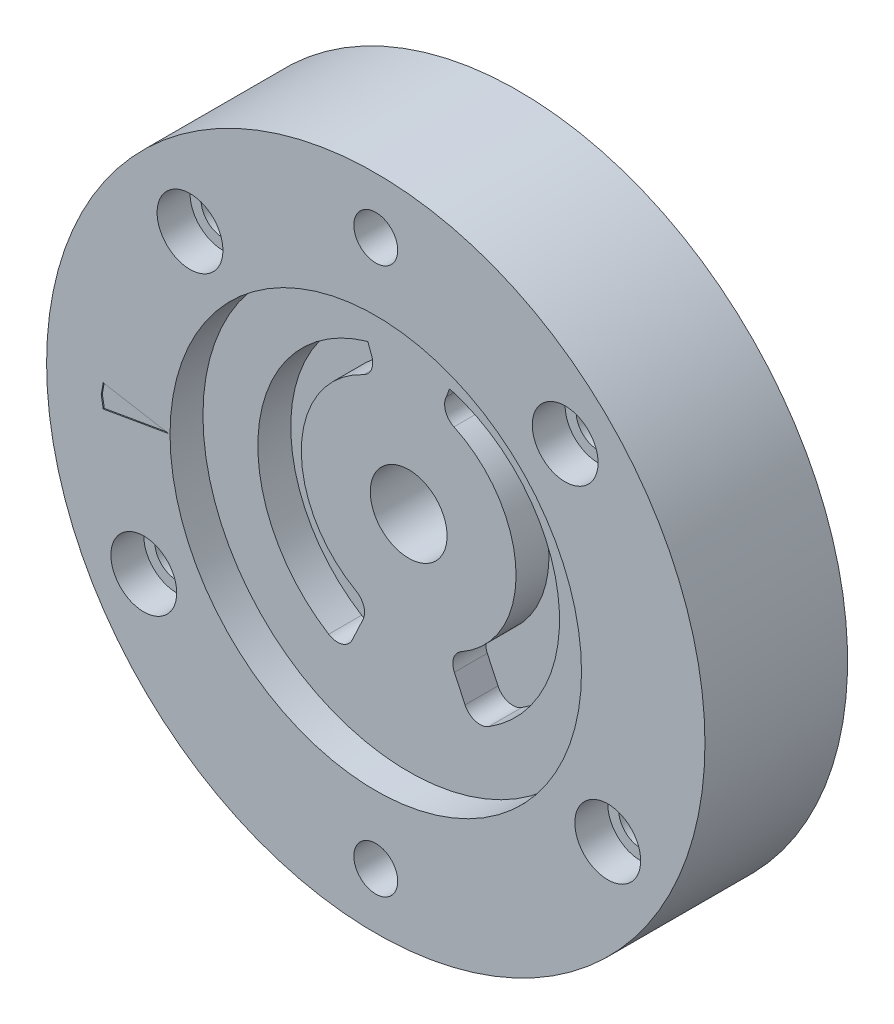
from build123d import *

# Parameters (mm, degrees)
ESQUISSE1_R             = 30
ESQUISSE1_R_2           = 18.75
BASE_EXTRUSION_DEPTH    = 3
BOSS_EXTRU_1_START      = 10
ESQUISSE2_R             = 30
ESQUISSE2_R_2           = 3.5
BOSS_EXTRU_1_DEPTH      = 10
ENL_V_MAT_EXTRU_1_DEPTH = 0.1
ESQUISSE4_R             = 2
ENL_V_MAT_EXTRU_2_DEPTH = 45.373415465
ESQUISSE5_R             = 3
ENL_V_MAT_EXTRU_3_DEPTH = 3
ENL_V_MAT_EXTRU_4_DEPTH = 3


with BuildPart() as part:
    # Esquisse1 → Base-Extrusion (new body)
    with BuildSketch(Plane.XY):
        with Locations(Location((0, 0, 0), (0, 0, 180))):
            Circle(ESQUISSE1_R)
        Circle(ESQUISSE1_R_2, mode=Mode.SUBTRACT)
    extrude(amount=BASE_EXTRUSION_DEPTH)

    # Esquisse2 → Boss.-Extru.1 (add)
    with BuildSketch(Plane(origin=(0, 0, 0), x_dir=(-1, 0, 0), z_dir=(0, 0, -1)).offset(BOSS_EXTRU_1_START)):
        Circle(ESQUISSE2_R)
        with Locations((0, 1.6)):
            Circle(ESQUISSE2_R_2, mode=Mode.SUBTRACT)
    extrude(amount=-BOSS_EXTRU_1_DEPTH)

    # Esquisse3 → Enl_v. mat.-Extru.1 (cut)
    with BuildSketch(Plane.XY.offset(3)):
        Polygon((-18.871595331, 0), (-24.837872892, 1.037613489), (-25.018327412, 0), (-24.837872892, -1.037613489), align=None)
    extrude(amount=-ENL_V_MAT_EXTRU_1_DEPTH, mode=Mode.SUBTRACT)

    # Esquisse4 → Enl_v. mat.-Extru.2 (cut, through all)
    with BuildSketch(Plane(origin=(0, 0, -10), x_dir=(-1, 0, 0), z_dir=(0, 0, -1))):
        with Locations((0, 24.902723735)):
            Circle(ESQUISSE4_R)
        with Locations((-17.261062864, 17.261062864)):
            Circle(ESQUISSE4_R)
        with Locations(Location((16.928701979, 16.928701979, 0), (0, 0, 180))):
            Circle(ESQUISSE4_R)
        with Locations(Location((0, -24.902723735, 0), (0, 0, 180))):
            Circle(ESQUISSE4_R)
        with Locations(Location((-21.140398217, -12.205414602, 0), (0, 0, 180))):
            Circle(ESQUISSE4_R)
        with Locations((21.140398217, -12.205414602)):
            Circle(ESQUISSE4_R)
    extrude(amount=-ENL_V_MAT_EXTRU_2_DEPTH, mode=Mode.SUBTRACT)

    # Esquisse5 → Enl_v. mat.-Extru.3 (cut)
    with BuildSketch(Plane.XY.offset(3)):
        with Locations((-16.928701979, 16.928701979)):
            Circle(ESQUISSE5_R)
        with Locations((17.261062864, 17.261062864)):
            Circle(ESQUISSE5_R)
        with Locations((21.140398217, -12.205414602)):
            Circle(ESQUISSE5_R)
        with Locations((-21.140398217, -12.205414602)):
            Circle(ESQUISSE5_R)
    extrude(amount=-ENL_V_MAT_EXTRU_3_DEPTH, mode=Mode.SUBTRACT)

    # Esquisse6 → Enl_v. mat.-Extru.4 (cut)
    with BuildSketch(Plane.XY):
        with BuildLine():
            Line((-3.439966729, 12.566763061), (-3.723682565, 13.346265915))
            ThreePointArc((-3.723682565, 13.346265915), (-13.608169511, 2.06401537), (-7.292100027, -11.541113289))
            ThreePointArc((-7.292100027, -11.541113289), (-6.070860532, -11.707886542), (-5.13698261, -10.903454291))
            Line((-5.13698261, -10.903454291), (-4.164639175, -8.818257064))
            ThreePointArc((-4.164639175, -8.818257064), (-4.096284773, -7.724611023), (-4.78989806, -6.876298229))
            ThreePointArc((-4.78989806, -6.876298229), (-9.778761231, 2.031373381), (-4.123842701, 10.531800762))
            ThreePointArc((-4.123842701, 10.531800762), (-3.353228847, 11.405219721), (-3.439966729, 12.566763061))
        make_face()
        with BuildLine():
            Line((4.164639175, -8.818257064), (5.13698261, -10.903454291))
            ThreePointArc((5.13698261, -10.903454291), (6.070860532, -11.707886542), (7.292100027, -11.541113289))
            ThreePointArc((7.292100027, -11.541113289), (13.608169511, 2.06401537), (3.723682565, 13.346265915))
            Line((3.723682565, 13.346265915), (3.439966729, 12.566763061))
            ThreePointArc((3.439966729, 12.566763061), (3.353228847, 11.405219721), (4.123842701, 10.531800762))
            ThreePointArc((4.123842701, 10.531800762), (9.778761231, 2.031373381), (4.78989806, -6.876298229))
            ThreePointArc((4.78989806, -6.876298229), (4.096284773, -7.724611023), (4.164639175, -8.818257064))
        make_face()
    extrude(amount=-ENL_V_MAT_EXTRU_4_DEPTH, mode=Mode.SUBTRACT)


solid = part.part
